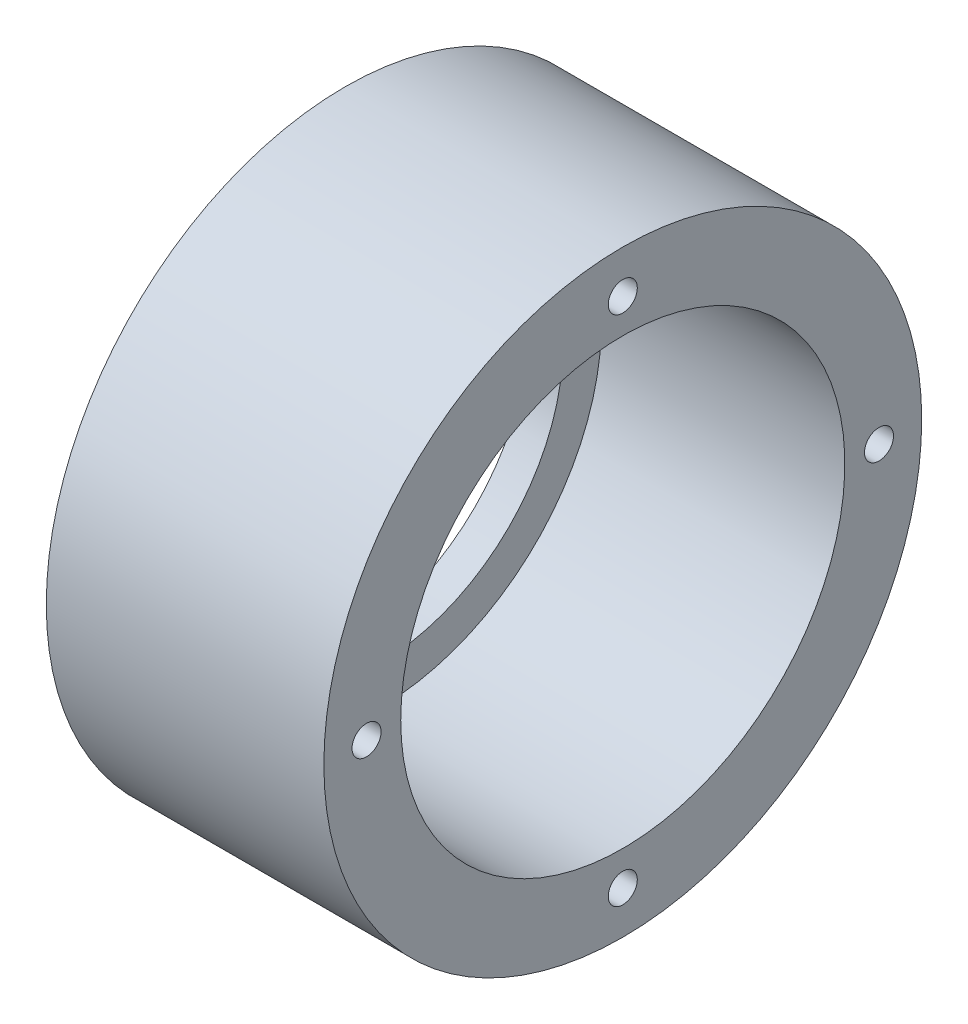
from build123d import *

# Parameters (mm, degrees)
CIRPATTERN1_COUNT = 4


with BuildPart() as part:
    # Sketch1 → Revolve1 (revolve)
    with BuildSketch(Plane.XY, mode=Mode.PRIVATE) as revolve1_sk:
        Polygon((0, 43), (0, 70), (65, 70), (65, 52), (8, 52), (8, 43), align=None)
    revolve(revolve1_sk.sketch.rotate(Axis((0, 0, 0), (1, 0, 0)), 90), axis=Axis((0, 0, 0), (1, 0, 0)))

    # Sketch5 → M8 Tapped Hole1 (revolve, cut)
    with BuildSketch(Plane(origin=(65, 60, 0), x_dir=(0, 0, -1), z_dir=(0, 1, 0))):
        Polygon((0, 0), (0, 24.042926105), (3.4, 22), (3.4, 0), align=None)
    m8_tapped_hole1 = revolve(axis=Axis((71.35, 60, 0), (-1, 0, 0)), mode=Mode.SUBTRACT)

    # CirPattern1: M8 Tapped Hole1 ×4 about axis
    cirpattern1_axis = Axis((0, 0, 0), (1, 0, 0))
    for i in range(1, CIRPATTERN1_COUNT):
        add(m8_tapped_hole1.rotate(cirpattern1_axis, i * 360 / CIRPATTERN1_COUNT), mode=Mode.SUBTRACT)


solid = part.part
